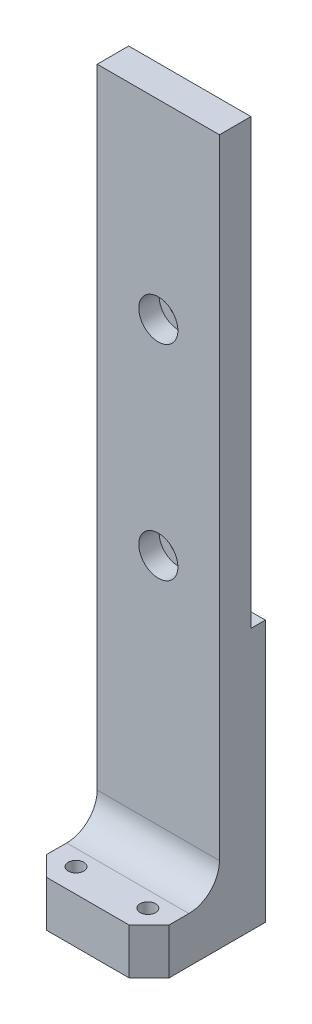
from build123d import *

# Parameters (mm, degrees)
SKETCH1_W                      = 20.32
SKETCH1_H                      = 90.17
EXTRUDE1_DEPTH                 = 15.24
SKETCH5_W                      = 20.32
SKETCH5_H                      = 7.62
EXTRUDE2_DEPTH                 = 27.0002
SKETCH10_W                     = 20.32
SKETCH10_H                     = 7.62
EXTRUDE3_DEPTH                 = 11.695303
SKETCH11_W                     = 20.32
SKETCH11_H                     = 90.17
CUT_EXTRUDE4_DEPTH             = 7.62
SKETCH13_W                     = 20.32
SKETCH13_H                     = 73.66
CUT_EXTRUDE6_DEPTH             = 2.3876
FILLET1_R                      = 5.08
F_5_40_TAPPED_HOLE1_D          = 2.5781
F_5_40_TAPPED_HOLE1_DEPTH      = 8.255
F_5_40_TAPPED_HOLE1_TIP        = 0.774539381
CHAMFER2_SIZE                  = 3.302
CBORE_FOR_M3_SHCS2_D           = 3.2
CBORE_FOR_M3_SHCS2_CBORE_D     = 6.5
CBORE_FOR_M3_SHCS2_CBORE_DEPTH = 3.381
M3X0_5_TAPPED_HOLE1_D          = 2.5
M3X0_5_TAPPED_HOLE1_DEPTH      = 7.62
M3X0_5_TAPPED_HOLE1_TIP        = 0.751075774


with BuildPart() as part:
    # Sketch1 → Extrude1 (new body)
    with BuildSketch(Plane.XY):
        with Locations((0, -24.765)):
            Rectangle(SKETCH1_W, SKETCH1_H)
    extrude(amount=EXTRUDE1_DEPTH)

    # Sketch5 → Extrude2 (add)
    with BuildSketch(Plane.XZ.offset(69.85)):
        with Locations((0, 11.43)):
            Rectangle(SKETCH5_W, SKETCH5_H)
    extrude(amount=EXTRUDE2_DEPTH)

    # Sketch10 → Extrude3 (add)
    with BuildSketch(Plane.XY.offset(15.24)):
        with Locations((0, -93.0402)):
            Rectangle(SKETCH10_W, SKETCH10_H)
    extrude(amount=EXTRUDE3_DEPTH)

    # Sketch11 → Cut-Extrude4 (cut)
    with BuildSketch(Plane(origin=(0, 0, 0), x_dir=(-1, 0, 0), z_dir=(0, 0, -1))):
        with Locations((0, -24.765)):
            Rectangle(SKETCH11_W, SKETCH11_H)
    extrude(amount=-CUT_EXTRUDE4_DEPTH, mode=Mode.SUBTRACT)

    # Sketch13 → Cut-Extrude6 (cut)
    with BuildSketch(Plane(origin=(0, 0, 7.62), x_dir=(-1, 0, 0), z_dir=(0, 0, -1))):
        with Locations((0, -16.51)):
            Rectangle(SKETCH13_W, SKETCH13_H)
    extrude(amount=-CUT_EXTRUDE6_DEPTH, mode=Mode.SUBTRACT)

    # Fillet1
    fillet1_edges = [part.edges().sort_by_distance(p)[0] for p in [
        (0, -89.2302, 15.24),
    ]]
    fillet(fillet1_edges, radius=FILLET1_R)

    # 5-40 Tapped Hole1
    with Locations(Plane.XZ.offset(96.8502)):
        with Locations((5.969, 11.603781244), (-5.969, 11.603781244), (-5.969, 22.951521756), (5.969, 22.951521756)):
            Hole(F_5_40_TAPPED_HOLE1_D / 2, depth=F_5_40_TAPPED_HOLE1_DEPTH)
            with Locations((0, 0, -(F_5_40_TAPPED_HOLE1_DEPTH + F_5_40_TAPPED_HOLE1_TIP / 2))):  # 118° drill point
                Cone(0, F_5_40_TAPPED_HOLE1_D / 2, F_5_40_TAPPED_HOLE1_TIP, mode=Mode.SUBTRACT)

    # Chamfer2
    chamfer2_edges = [part.edges().sort_by_distance(p)[0] for p in [
        (10.16, -93.0402, 26.935303),
        (-10.16, -93.0402, 26.935303),
    ]]
    chamfer(chamfer2_edges, length=CHAMFER2_SIZE)

    # CBORE for M3 SHCS2 (through all)
    with Locations(Plane(origin=(0, -45.339, 15.24), x_dir=(1, 0, 0), z_dir=(0, 0, 1))):
        with Locations((0, 0), (0, 34.0106)):
            CounterBoreHole(CBORE_FOR_M3_SHCS2_D / 2, CBORE_FOR_M3_SHCS2_CBORE_D / 2, CBORE_FOR_M3_SHCS2_CBORE_DEPTH)

    # M3x0.5 Tapped Hole1
    with Locations(Plane(origin=(-10.16, -81.6102, 11.43), x_dir=(0, -1, 0), z_dir=(-1, 0, 0))):
        with Locations((0, 0)):
            Hole(M3X0_5_TAPPED_HOLE1_D / 2, depth=M3X0_5_TAPPED_HOLE1_DEPTH)
            with Locations((0, 0, -(M3X0_5_TAPPED_HOLE1_DEPTH + M3X0_5_TAPPED_HOLE1_TIP / 2))):  # 118° drill point
                Cone(0, M3X0_5_TAPPED_HOLE1_D / 2, M3X0_5_TAPPED_HOLE1_TIP, mode=Mode.SUBTRACT)


solid = part.part
